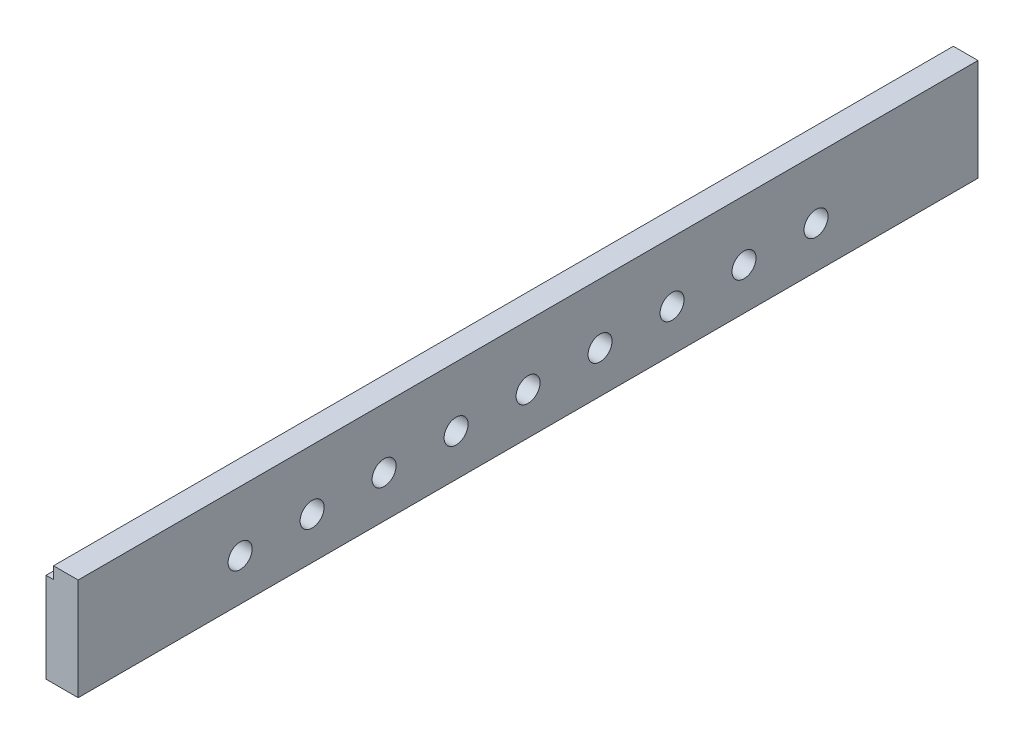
ISO-10303-21;
HEADER;
FILE_DESCRIPTION(('STEP AP214'),'2;1');
FILE_NAME('part.step','',(''),(''),'','','');
FILE_SCHEMA(('AUTOMOTIVE_DESIGN { 1 0 10303 214 1 1 1 1 }'));
ENDSEC;
DATA;
#1=APPLICATION_CONTEXT('core data for automotive mechanical design processes');
#2=APPLICATION_PROTOCOL_DEFINITION('international standard','automotive_design',2000,#1);
#3=PRODUCT_CONTEXT('',#1,'mechanical');
#4=PRODUCT('Part','Part','',(#3));
#5=PRODUCT_RELATED_PRODUCT_CATEGORY('part','',(#4));
#6=PRODUCT_DEFINITION_FORMATION('','',#4);
#7=PRODUCT_DEFINITION_CONTEXT('part definition',#1,'design');
#8=PRODUCT_DEFINITION('design','',#6,#7);
#9=PRODUCT_DEFINITION_SHAPE('','',#8);
#10=(LENGTH_UNIT() NAMED_UNIT(*) SI_UNIT(.MILLI.,.METRE.));
#11=(NAMED_UNIT(*) PLANE_ANGLE_UNIT() SI_UNIT($,.RADIAN.));
#12=(NAMED_UNIT(*) SI_UNIT($,.STERADIAN.) SOLID_ANGLE_UNIT());
#13=UNCERTAINTY_MEASURE_WITH_UNIT(LENGTH_MEASURE(1.E-05),#10,'distance_accuracy_value','');
#14=(GEOMETRIC_REPRESENTATION_CONTEXT(3) GLOBAL_UNCERTAINTY_ASSIGNED_CONTEXT((#13)) GLOBAL_UNIT_ASSIGNED_CONTEXT((#10,
#11,#12)) REPRESENTATION_CONTEXT('',''));
#15=CARTESIAN_POINT('',(0.,0.,0.));
#16=DIRECTION('',(0.,0.,1.));
#17=DIRECTION('',(1.,0.,0.));
#18=AXIS2_PLACEMENT_3D('',#15,#16,#17);
#19=CARTESIAN_POINT('',(5.36,0.,-150.));
#20=DIRECTION('',(0.,-1.,0.));
#21=DIRECTION('',(1.,0.,0.));
#22=AXIS2_PLACEMENT_3D('',#19,#20,#21);
#23=PLANE('',#22);
#24=DIRECTION('',(1.,0.,0.));
#25=VECTOR('',#24,1.);
#26=CARTESIAN_POINT('',(5.36,0.,0.));
#27=LINE('',#26,#25);
#28=CARTESIAN_POINT('',(0.,0.,0.));
#29=VERTEX_POINT('',#28);
#30=CARTESIAN_POINT('',(5.36,0.,0.));
#31=VERTEX_POINT('',#30);
#32=EDGE_CURVE('E124',#29,#31,#27,.T.);
#33=ORIENTED_EDGE('',*,*,#32,.F.);
#34=DIRECTION('',(0.,0.,1.));
#35=VECTOR('',#34,1.);
#36=CARTESIAN_POINT('',(0.,0.,-150.));
#37=LINE('',#36,#35);
#38=CARTESIAN_POINT('',(0.,0.,-150.));
#39=VERTEX_POINT('',#38);
#40=EDGE_CURVE('E53',#39,#29,#37,.T.);
#41=ORIENTED_EDGE('',*,*,#40,.F.);
#42=DIRECTION('',(1.,0.,0.));
#43=VECTOR('',#42,1.);
#44=CARTESIAN_POINT('',(5.36,0.,-150.));
#45=LINE('',#44,#43);
#46=CARTESIAN_POINT('',(5.36,0.,-150.));
#47=VERTEX_POINT('',#46);
#48=EDGE_CURVE('E140',#39,#47,#45,.T.);
#49=ORIENTED_EDGE('',*,*,#48,.T.);
#50=DIRECTION('',(0.,0.,1.));
#51=VECTOR('',#50,1.);
#52=CARTESIAN_POINT('',(5.36,0.,-150.));
#53=LINE('',#52,#51);
#54=EDGE_CURVE('E88',#47,#31,#53,.T.);
#55=ORIENTED_EDGE('',*,*,#54,.T.);
#56=EDGE_LOOP('',(#33,#41,#49,#55));
#57=FACE_BOUND('',#56,.T.);
#58=ADVANCED_FACE('F36',(#57),#23,.T.);
#59=CARTESIAN_POINT('',(0.,0.,-150.));
#60=DIRECTION('',(-1.,0.,0.));
#61=DIRECTION('',(0.,0.,1.));
#62=AXIS2_PLACEMENT_3D('',#59,#60,#61);
#63=PLANE('',#62);
#64=CARTESIAN_POINT('',(0.,7.,-111.));
#65=DIRECTION('',(-1.,0.,0.));
#66=DIRECTION('',(0.,0.,1.));
#67=AXIS2_PLACEMENT_3D('',#64,#65,#66);
#68=CIRCLE('',#67,2.);
#69=CARTESIAN_POINT('',(0.,7.,-109.));
#70=VERTEX_POINT('',#69);
#71=EDGE_CURVE('E383',#70,#70,#68,.T.);
#72=ORIENTED_EDGE('',*,*,#71,.F.);
#73=EDGE_LOOP('',(#72));
#74=FACE_BOUND('',#73,.T.);
#75=CARTESIAN_POINT('',(0.,7.,-123.));
#76=DIRECTION('',(-1.,0.,0.));
#77=DIRECTION('',(0.,0.,1.));
#78=AXIS2_PLACEMENT_3D('',#75,#76,#77);
#79=CIRCLE('',#78,2.);
#80=CARTESIAN_POINT('',(0.,7.,-121.));
#81=VERTEX_POINT('',#80);
#82=EDGE_CURVE('E384',#81,#81,#79,.T.);
#83=ORIENTED_EDGE('',*,*,#82,.F.);
#84=EDGE_LOOP('',(#83));
#85=FACE_BOUND('',#84,.T.);
#86=DIRECTION('',(0.,-1.,0.));
#87=VECTOR('',#86,1.);
#88=CARTESIAN_POINT('',(0.,0.,0.));
#89=LINE('',#88,#87);
#90=CARTESIAN_POINT('',(0.,15.,0.));
#91=VERTEX_POINT('',#90);
#92=EDGE_CURVE('E137',#91,#29,#89,.T.);
#93=ORIENTED_EDGE('',*,*,#92,.F.);
#94=DIRECTION('',(0.,0.,1.));
#95=VECTOR('',#94,1.);
#96=CARTESIAN_POINT('',(0.,15.,-150.));
#97=LINE('',#96,#95);
#98=CARTESIAN_POINT('',(0.,15.,-150.));
#99=VERTEX_POINT('',#98);
#100=EDGE_CURVE('E76',#99,#91,#97,.T.);
#101=ORIENTED_EDGE('',*,*,#100,.F.);
#102=DIRECTION('',(0.,-1.,0.));
#103=VECTOR('',#102,1.);
#104=CARTESIAN_POINT('',(0.,0.,-150.));
#105=LINE('',#104,#103);
#106=EDGE_CURVE('E114',#99,#39,#105,.T.);
#107=ORIENTED_EDGE('',*,*,#106,.T.);
#108=ORIENTED_EDGE('',*,*,#40,.T.);
#109=EDGE_LOOP('',(#93,#101,#107,#108));
#110=FACE_BOUND('',#109,.T.);
#111=CARTESIAN_POINT('',(0.,7.,-99.));
#112=DIRECTION('',(-1.,0.,0.));
#113=DIRECTION('',(0.,0.,1.));
#114=AXIS2_PLACEMENT_3D('',#111,#112,#113);
#115=CIRCLE('',#114,2.);
#116=CARTESIAN_POINT('',(0.,7.,-97.));
#117=VERTEX_POINT('',#116);
#118=EDGE_CURVE('E150',#117,#117,#115,.T.);
#119=ORIENTED_EDGE('',*,*,#118,.F.);
#120=EDGE_LOOP('',(#119));
#121=FACE_BOUND('',#120,.T.);
#122=CARTESIAN_POINT('',(0.,7.,-87.));
#123=DIRECTION('',(-1.,0.,0.));
#124=DIRECTION('',(0.,0.,1.));
#125=AXIS2_PLACEMENT_3D('',#122,#123,#124);
#126=CIRCLE('',#125,2.);
#127=CARTESIAN_POINT('',(0.,7.,-85.));
#128=VERTEX_POINT('',#127);
#129=EDGE_CURVE('E156',#128,#128,#126,.T.);
#130=ORIENTED_EDGE('',*,*,#129,.F.);
#131=EDGE_LOOP('',(#130));
#132=FACE_BOUND('',#131,.T.);
#133=CARTESIAN_POINT('',(0.,7.,-75.));
#134=DIRECTION('',(-1.,0.,0.));
#135=DIRECTION('',(0.,0.,1.));
#136=AXIS2_PLACEMENT_3D('',#133,#134,#135);
#137=CIRCLE('',#136,2.);
#138=CARTESIAN_POINT('',(0.,7.,-73.));
#139=VERTEX_POINT('',#138);
#140=EDGE_CURVE('E162',#139,#139,#137,.T.);
#141=ORIENTED_EDGE('',*,*,#140,.F.);
#142=EDGE_LOOP('',(#141));
#143=FACE_BOUND('',#142,.T.);
#144=CARTESIAN_POINT('',(0.,7.,-63.));
#145=DIRECTION('',(-1.,0.,0.));
#146=DIRECTION('',(0.,0.,1.));
#147=AXIS2_PLACEMENT_3D('',#144,#145,#146);
#148=CIRCLE('',#147,2.);
#149=CARTESIAN_POINT('',(0.,7.,-61.));
#150=VERTEX_POINT('',#149);
#151=EDGE_CURVE('E168',#150,#150,#148,.T.);
#152=ORIENTED_EDGE('',*,*,#151,.F.);
#153=EDGE_LOOP('',(#152));
#154=FACE_BOUND('',#153,.T.);
#155=CARTESIAN_POINT('',(0.,7.,-51.));
#156=DIRECTION('',(-1.,0.,0.));
#157=DIRECTION('',(0.,0.,1.));
#158=AXIS2_PLACEMENT_3D('',#155,#156,#157);
#159=CIRCLE('',#158,2.);
#160=CARTESIAN_POINT('',(0.,7.,-49.));
#161=VERTEX_POINT('',#160);
#162=EDGE_CURVE('E174',#161,#161,#159,.T.);
#163=ORIENTED_EDGE('',*,*,#162,.F.);
#164=EDGE_LOOP('',(#163));
#165=FACE_BOUND('',#164,.T.);
#166=CARTESIAN_POINT('',(0.,7.,-39.));
#167=DIRECTION('',(-1.,0.,0.));
#168=DIRECTION('',(0.,0.,1.));
#169=AXIS2_PLACEMENT_3D('',#166,#167,#168);
#170=CIRCLE('',#169,2.);
#171=CARTESIAN_POINT('',(0.,7.,-37.));
#172=VERTEX_POINT('',#171);
#173=EDGE_CURVE('E180',#172,#172,#170,.T.);
#174=ORIENTED_EDGE('',*,*,#173,.F.);
#175=EDGE_LOOP('',(#174));
#176=FACE_BOUND('',#175,.T.);
#177=CARTESIAN_POINT('',(0.,7.,-27.));
#178=DIRECTION('',(-1.,0.,0.));
#179=DIRECTION('',(0.,0.,1.));
#180=AXIS2_PLACEMENT_3D('',#177,#178,#179);
#181=CIRCLE('',#180,2.);
#182=CARTESIAN_POINT('',(0.,7.,-25.));
#183=VERTEX_POINT('',#182);
#184=EDGE_CURVE('E11',#183,#183,#181,.T.);
#185=ORIENTED_EDGE('',*,*,#184,.F.);
#186=EDGE_LOOP('',(#185));
#187=FACE_BOUND('',#186,.T.);
#188=ADVANCED_FACE('F192',(#74,#85,#110,#121,#132,#143,#154,#165,#176,#187),#63,.T.);
#189=CARTESIAN_POINT('',(0.,15.,-150.));
#190=DIRECTION('',(0.,1.,0.));
#191=DIRECTION('',(0.,0.,1.));
#192=AXIS2_PLACEMENT_3D('',#189,#190,#191);
#193=PLANE('',#192);
#194=DIRECTION('',(-1.,0.,0.));
#195=VECTOR('',#194,1.);
#196=CARTESIAN_POINT('',(0.,15.,0.));
#197=LINE('',#196,#195);
#198=CARTESIAN_POINT('',(1.25,15.,0.));
#199=VERTEX_POINT('',#198);
#200=EDGE_CURVE('E101',#199,#91,#197,.T.);
#201=ORIENTED_EDGE('',*,*,#200,.F.);
#202=DIRECTION('',(0.,0.,1.));
#203=VECTOR('',#202,1.);
#204=CARTESIAN_POINT('',(1.25,15.,-150.));
#205=LINE('',#204,#203);
#206=CARTESIAN_POINT('',(1.25,15.,-150.));
#207=VERTEX_POINT('',#206);
#208=EDGE_CURVE('E96',#207,#199,#205,.T.);
#209=ORIENTED_EDGE('',*,*,#208,.F.);
#210=DIRECTION('',(-1.,0.,0.));
#211=VECTOR('',#210,1.);
#212=CARTESIAN_POINT('',(0.,15.,-150.));
#213=LINE('',#212,#211);
#214=EDGE_CURVE('E99',#207,#99,#213,.T.);
#215=ORIENTED_EDGE('',*,*,#214,.T.);
#216=ORIENTED_EDGE('',*,*,#100,.T.);
#217=EDGE_LOOP('',(#201,#209,#215,#216));
#218=FACE_BOUND('',#217,.T.);
#219=ADVANCED_FACE('F98',(#218),#193,.T.);
#220=CARTESIAN_POINT('',(1.25,15.,-150.));
#221=DIRECTION('',(-1.,0.,0.));
#222=DIRECTION('',(0.,0.,1.));
#223=AXIS2_PLACEMENT_3D('',#220,#221,#222);
#224=PLANE('',#223);
#225=DIRECTION('',(0.,-1.,0.));
#226=VECTOR('',#225,1.);
#227=CARTESIAN_POINT('',(1.25,15.,0.));
#228=LINE('',#227,#226);
#229=CARTESIAN_POINT('',(1.25,17.,0.));
#230=VERTEX_POINT('',#229);
#231=EDGE_CURVE('E134',#230,#199,#228,.T.);
#232=ORIENTED_EDGE('',*,*,#231,.F.);
#233=DIRECTION('',(0.,0.,1.));
#234=VECTOR('',#233,1.);
#235=CARTESIAN_POINT('',(1.25,17.,-150.));
#236=LINE('',#235,#234);
#237=CARTESIAN_POINT('',(1.25,17.,-150.));
#238=VERTEX_POINT('',#237);
#239=EDGE_CURVE('E106',#238,#230,#236,.T.);
#240=ORIENTED_EDGE('',*,*,#239,.F.);
#241=DIRECTION('',(0.,-1.,0.));
#242=VECTOR('',#241,1.);
#243=CARTESIAN_POINT('',(1.25,15.,-150.));
#244=LINE('',#243,#242);
#245=EDGE_CURVE('E112',#238,#207,#244,.T.);
#246=ORIENTED_EDGE('',*,*,#245,.T.);
#247=ORIENTED_EDGE('',*,*,#208,.T.);
#248=EDGE_LOOP('',(#232,#240,#246,#247));
#249=FACE_BOUND('',#248,.T.);
#250=ADVANCED_FACE('F116',(#249),#224,.T.);
#251=CARTESIAN_POINT('',(1.25,17.,-150.));
#252=DIRECTION('',(0.,1.,0.));
#253=DIRECTION('',(0.,0.,1.));
#254=AXIS2_PLACEMENT_3D('',#251,#252,#253);
#255=PLANE('',#254);
#256=DIRECTION('',(-1.,0.,0.));
#257=VECTOR('',#256,1.);
#258=CARTESIAN_POINT('',(1.25,17.,0.));
#259=LINE('',#258,#257);
#260=CARTESIAN_POINT('',(5.36,17.,0.));
#261=VERTEX_POINT('',#260);
#262=EDGE_CURVE('E131',#261,#230,#259,.T.);
#263=ORIENTED_EDGE('',*,*,#262,.F.);
#264=DIRECTION('',(0.,0.,1.));
#265=VECTOR('',#264,1.);
#266=CARTESIAN_POINT('',(5.36,17.,-150.));
#267=LINE('',#266,#265);
#268=CARTESIAN_POINT('',(5.36,17.,-150.));
#269=VERTEX_POINT('',#268);
#270=EDGE_CURVE('E145',#269,#261,#267,.T.);
#271=ORIENTED_EDGE('',*,*,#270,.F.);
#272=DIRECTION('',(-1.,0.,0.));
#273=VECTOR('',#272,1.);
#274=CARTESIAN_POINT('',(1.25,17.,-150.));
#275=LINE('',#274,#273);
#276=EDGE_CURVE('E117',#269,#238,#275,.T.);
#277=ORIENTED_EDGE('',*,*,#276,.T.);
#278=ORIENTED_EDGE('',*,*,#239,.T.);
#279=EDGE_LOOP('',(#263,#271,#277,#278));
#280=FACE_BOUND('',#279,.T.);
#281=ADVANCED_FACE('F210',(#280),#255,.T.);
#282=CARTESIAN_POINT('',(5.36,17.,-150.));
#283=DIRECTION('',(1.,0.,0.));
#284=DIRECTION('',(0.,1.,0.));
#285=AXIS2_PLACEMENT_3D('',#282,#283,#284);
#286=PLANE('',#285);
#287=CARTESIAN_POINT('',(5.36,7.,-111.));
#288=DIRECTION('',(-1.,0.,0.));
#289=DIRECTION('',(0.,0.,1.));
#290=AXIS2_PLACEMENT_3D('',#287,#288,#289);
#291=CIRCLE('',#290,2.);
#292=CARTESIAN_POINT('',(5.36,7.,-109.));
#293=VERTEX_POINT('',#292);
#294=EDGE_CURVE('E381',#293,#293,#291,.T.);
#295=ORIENTED_EDGE('',*,*,#294,.T.);
#296=EDGE_LOOP('',(#295));
#297=FACE_BOUND('',#296,.T.);
#298=CARTESIAN_POINT('',(5.36,7.,-123.));
#299=DIRECTION('',(-1.,0.,0.));
#300=DIRECTION('',(0.,0.,1.));
#301=AXIS2_PLACEMENT_3D('',#298,#299,#300);
#302=CIRCLE('',#301,2.);
#303=CARTESIAN_POINT('',(5.36,7.,-121.));
#304=VERTEX_POINT('',#303);
#305=EDGE_CURVE('E128',#304,#304,#302,.T.);
#306=ORIENTED_EDGE('',*,*,#305,.T.);
#307=EDGE_LOOP('',(#306));
#308=FACE_BOUND('',#307,.T.);
#309=DIRECTION('',(0.,1.,0.));
#310=VECTOR('',#309,1.);
#311=CARTESIAN_POINT('',(5.36,17.,0.));
#312=LINE('',#311,#310);
#313=EDGE_CURVE('E127',#31,#261,#312,.T.);
#314=ORIENTED_EDGE('',*,*,#313,.F.);
#315=ORIENTED_EDGE('',*,*,#54,.F.);
#316=DIRECTION('',(0.,1.,0.));
#317=VECTOR('',#316,1.);
#318=CARTESIAN_POINT('',(5.36,17.,-150.));
#319=LINE('',#318,#317);
#320=EDGE_CURVE('E119',#47,#269,#319,.T.);
#321=ORIENTED_EDGE('',*,*,#320,.T.);
#322=ORIENTED_EDGE('',*,*,#270,.T.);
#323=EDGE_LOOP('',(#314,#315,#321,#322));
#324=FACE_BOUND('',#323,.T.);
#325=CARTESIAN_POINT('',(5.36,7.,-99.));
#326=DIRECTION('',(-1.,0.,0.));
#327=DIRECTION('',(0.,0.,1.));
#328=AXIS2_PLACEMENT_3D('',#325,#326,#327);
#329=CIRCLE('',#328,2.);
#330=CARTESIAN_POINT('',(5.36,7.,-97.));
#331=VERTEX_POINT('',#330);
#332=EDGE_CURVE('E142',#331,#331,#329,.T.);
#333=ORIENTED_EDGE('',*,*,#332,.T.);
#334=EDGE_LOOP('',(#333));
#335=FACE_BOUND('',#334,.T.);
#336=CARTESIAN_POINT('',(5.36,7.,-87.));
#337=DIRECTION('',(-1.,0.,0.));
#338=DIRECTION('',(0.,0.,1.));
#339=AXIS2_PLACEMENT_3D('',#336,#337,#338);
#340=CIRCLE('',#339,2.);
#341=CARTESIAN_POINT('',(5.36,7.,-85.));
#342=VERTEX_POINT('',#341);
#343=EDGE_CURVE('E153',#342,#342,#340,.T.);
#344=ORIENTED_EDGE('',*,*,#343,.T.);
#345=EDGE_LOOP('',(#344));
#346=FACE_BOUND('',#345,.T.);
#347=CARTESIAN_POINT('',(5.36,7.,-75.));
#348=DIRECTION('',(-1.,0.,0.));
#349=DIRECTION('',(0.,0.,1.));
#350=AXIS2_PLACEMENT_3D('',#347,#348,#349);
#351=CIRCLE('',#350,2.);
#352=CARTESIAN_POINT('',(5.36,7.,-73.));
#353=VERTEX_POINT('',#352);
#354=EDGE_CURVE('E159',#353,#353,#351,.T.);
#355=ORIENTED_EDGE('',*,*,#354,.T.);
#356=EDGE_LOOP('',(#355));
#357=FACE_BOUND('',#356,.T.);
#358=CARTESIAN_POINT('',(5.36,7.,-63.));
#359=DIRECTION('',(-1.,0.,0.));
#360=DIRECTION('',(0.,0.,1.));
#361=AXIS2_PLACEMENT_3D('',#358,#359,#360);
#362=CIRCLE('',#361,2.);
#363=CARTESIAN_POINT('',(5.36,7.,-61.));
#364=VERTEX_POINT('',#363);
#365=EDGE_CURVE('E165',#364,#364,#362,.T.);
#366=ORIENTED_EDGE('',*,*,#365,.T.);
#367=EDGE_LOOP('',(#366));
#368=FACE_BOUND('',#367,.T.);
#369=CARTESIAN_POINT('',(5.36,7.,-51.));
#370=DIRECTION('',(-1.,0.,0.));
#371=DIRECTION('',(0.,0.,1.));
#372=AXIS2_PLACEMENT_3D('',#369,#370,#371);
#373=CIRCLE('',#372,2.);
#374=CARTESIAN_POINT('',(5.36,7.,-49.));
#375=VERTEX_POINT('',#374);
#376=EDGE_CURVE('E171',#375,#375,#373,.T.);
#377=ORIENTED_EDGE('',*,*,#376,.T.);
#378=EDGE_LOOP('',(#377));
#379=FACE_BOUND('',#378,.T.);
#380=CARTESIAN_POINT('',(5.36,7.,-39.));
#381=DIRECTION('',(-1.,0.,0.));
#382=DIRECTION('',(0.,0.,1.));
#383=AXIS2_PLACEMENT_3D('',#380,#381,#382);
#384=CIRCLE('',#383,2.);
#385=CARTESIAN_POINT('',(5.36,7.,-37.));
#386=VERTEX_POINT('',#385);
#387=EDGE_CURVE('E177',#386,#386,#384,.T.);
#388=ORIENTED_EDGE('',*,*,#387,.T.);
#389=EDGE_LOOP('',(#388));
#390=FACE_BOUND('',#389,.T.);
#391=CARTESIAN_POINT('',(5.36,7.,-27.));
#392=DIRECTION('',(-1.,0.,0.));
#393=DIRECTION('',(0.,0.,1.));
#394=AXIS2_PLACEMENT_3D('',#391,#392,#393);
#395=CIRCLE('',#394,2.);
#396=CARTESIAN_POINT('',(5.36,7.,-25.));
#397=VERTEX_POINT('',#396);
#398=EDGE_CURVE('E45',#397,#397,#395,.T.);
#399=ORIENTED_EDGE('',*,*,#398,.T.);
#400=EDGE_LOOP('',(#399));
#401=FACE_BOUND('',#400,.T.);
#402=ADVANCED_FACE('F185',(#297,#308,#324,#335,#346,#357,#368,#379,#390,#401),#286,.T.);
#403=CARTESIAN_POINT('',(5.36,0.,-150.));
#404=DIRECTION('',(0.,0.,1.));
#405=DIRECTION('',(1.,0.,0.));
#406=AXIS2_PLACEMENT_3D('',#403,#404,#405);
#407=PLANE('',#406);
#408=ORIENTED_EDGE('',*,*,#48,.F.);
#409=ORIENTED_EDGE('',*,*,#106,.F.);
#410=ORIENTED_EDGE('',*,*,#214,.F.);
#411=ORIENTED_EDGE('',*,*,#245,.F.);
#412=ORIENTED_EDGE('',*,*,#276,.F.);
#413=ORIENTED_EDGE('',*,*,#320,.F.);
#414=EDGE_LOOP('',(#408,#409,#410,#411,#412,#413));
#415=FACE_BOUND('',#414,.T.);
#416=ADVANCED_FACE('F110',(#415),#407,.F.);
#417=CARTESIAN_POINT('',(5.36,0.,0.));
#418=DIRECTION('',(0.,0.,1.));
#419=DIRECTION('',(1.,0.,0.));
#420=AXIS2_PLACEMENT_3D('',#417,#418,#419);
#421=PLANE('',#420);
#422=ORIENTED_EDGE('',*,*,#32,.T.);
#423=ORIENTED_EDGE('',*,*,#313,.T.);
#424=ORIENTED_EDGE('',*,*,#262,.T.);
#425=ORIENTED_EDGE('',*,*,#231,.T.);
#426=ORIENTED_EDGE('',*,*,#200,.T.);
#427=ORIENTED_EDGE('',*,*,#92,.T.);
#428=EDGE_LOOP('',(#422,#423,#424,#425,#426,#427));
#429=FACE_BOUND('',#428,.T.);
#430=ADVANCED_FACE('F205',(#429),#421,.T.);
#431=CARTESIAN_POINT('',(5.36,7.,-123.));
#432=DIRECTION('',(-1.,0.,0.));
#433=DIRECTION('',(0.,0.,1.));
#434=AXIS2_PLACEMENT_3D('',#431,#432,#433);
#435=CYLINDRICAL_SURFACE('',#434,2.);
#436=ORIENTED_EDGE('',*,*,#305,.F.);
#437=EDGE_LOOP('',(#436));
#438=FACE_BOUND('',#437,.T.);
#439=ORIENTED_EDGE('',*,*,#82,.T.);
#440=EDGE_LOOP('',(#439));
#441=FACE_BOUND('',#440,.T.);
#442=ADVANCED_FACE('F257',(#438,#441),#435,.F.);
#443=CARTESIAN_POINT('',(5.36,7.,-111.));
#444=DIRECTION('',(-1.,0.,0.));
#445=DIRECTION('',(0.,0.,1.));
#446=AXIS2_PLACEMENT_3D('',#443,#444,#445);
#447=CYLINDRICAL_SURFACE('',#446,2.);
#448=ORIENTED_EDGE('',*,*,#294,.F.);
#449=EDGE_LOOP('',(#448));
#450=FACE_BOUND('',#449,.T.);
#451=ORIENTED_EDGE('',*,*,#71,.T.);
#452=EDGE_LOOP('',(#451));
#453=FACE_BOUND('',#452,.T.);
#454=ADVANCED_FACE('F221',(#450,#453),#447,.F.);
#455=CARTESIAN_POINT('',(5.36,7.,-99.));
#456=DIRECTION('',(-1.,0.,0.));
#457=DIRECTION('',(0.,0.,1.));
#458=AXIS2_PLACEMENT_3D('',#455,#456,#457);
#459=CYLINDRICAL_SURFACE('',#458,2.);
#460=ORIENTED_EDGE('',*,*,#332,.F.);
#461=EDGE_LOOP('',(#460));
#462=FACE_BOUND('',#461,.T.);
#463=ORIENTED_EDGE('',*,*,#118,.T.);
#464=EDGE_LOOP('',(#463));
#465=FACE_BOUND('',#464,.T.);
#466=ADVANCED_FACE('F217',(#462,#465),#459,.F.);
#467=CARTESIAN_POINT('',(5.36,7.,-87.));
#468=DIRECTION('',(-1.,0.,0.));
#469=DIRECTION('',(0.,0.,1.));
#470=AXIS2_PLACEMENT_3D('',#467,#468,#469);
#471=CYLINDRICAL_SURFACE('',#470,2.);
#472=ORIENTED_EDGE('',*,*,#343,.F.);
#473=EDGE_LOOP('',(#472));
#474=FACE_BOUND('',#473,.T.);
#475=ORIENTED_EDGE('',*,*,#129,.T.);
#476=EDGE_LOOP('',(#475));
#477=FACE_BOUND('',#476,.T.);
#478=ADVANCED_FACE('F220',(#474,#477),#471,.F.);
#479=CARTESIAN_POINT('',(5.36,7.,-75.));
#480=DIRECTION('',(-1.,0.,0.));
#481=DIRECTION('',(0.,0.,1.));
#482=AXIS2_PLACEMENT_3D('',#479,#480,#481);
#483=CYLINDRICAL_SURFACE('',#482,2.);
#484=ORIENTED_EDGE('',*,*,#354,.F.);
#485=EDGE_LOOP('',(#484));
#486=FACE_BOUND('',#485,.T.);
#487=ORIENTED_EDGE('',*,*,#140,.T.);
#488=EDGE_LOOP('',(#487));
#489=FACE_BOUND('',#488,.T.);
#490=ADVANCED_FACE('F225',(#486,#489),#483,.F.);
#491=CARTESIAN_POINT('',(5.36,7.,-63.));
#492=DIRECTION('',(-1.,0.,0.));
#493=DIRECTION('',(0.,0.,1.));
#494=AXIS2_PLACEMENT_3D('',#491,#492,#493);
#495=CYLINDRICAL_SURFACE('',#494,2.);
#496=ORIENTED_EDGE('',*,*,#365,.F.);
#497=EDGE_LOOP('',(#496));
#498=FACE_BOUND('',#497,.T.);
#499=ORIENTED_EDGE('',*,*,#151,.T.);
#500=EDGE_LOOP('',(#499));
#501=FACE_BOUND('',#500,.T.);
#502=ADVANCED_FACE('F229',(#498,#501),#495,.F.);
#503=CARTESIAN_POINT('',(5.36,7.,-51.));
#504=DIRECTION('',(-1.,0.,0.));
#505=DIRECTION('',(0.,0.,1.));
#506=AXIS2_PLACEMENT_3D('',#503,#504,#505);
#507=CYLINDRICAL_SURFACE('',#506,2.);
#508=ORIENTED_EDGE('',*,*,#376,.F.);
#509=EDGE_LOOP('',(#508));
#510=FACE_BOUND('',#509,.T.);
#511=ORIENTED_EDGE('',*,*,#162,.T.);
#512=EDGE_LOOP('',(#511));
#513=FACE_BOUND('',#512,.T.);
#514=ADVANCED_FACE('F233',(#510,#513),#507,.F.);
#515=CARTESIAN_POINT('',(5.36,7.,-39.));
#516=DIRECTION('',(-1.,0.,0.));
#517=DIRECTION('',(0.,0.,1.));
#518=AXIS2_PLACEMENT_3D('',#515,#516,#517);
#519=CYLINDRICAL_SURFACE('',#518,2.);
#520=ORIENTED_EDGE('',*,*,#387,.F.);
#521=EDGE_LOOP('',(#520));
#522=FACE_BOUND('',#521,.T.);
#523=ORIENTED_EDGE('',*,*,#173,.T.);
#524=EDGE_LOOP('',(#523));
#525=FACE_BOUND('',#524,.T.);
#526=ADVANCED_FACE('F189',(#522,#525),#519,.F.);
#527=CARTESIAN_POINT('',(5.36,7.,-27.));
#528=DIRECTION('',(-1.,0.,0.));
#529=DIRECTION('',(0.,0.,1.));
#530=AXIS2_PLACEMENT_3D('',#527,#528,#529);
#531=CYLINDRICAL_SURFACE('',#530,2.);
#532=ORIENTED_EDGE('',*,*,#398,.F.);
#533=EDGE_LOOP('',(#532));
#534=FACE_BOUND('',#533,.T.);
#535=ORIENTED_EDGE('',*,*,#184,.T.);
#536=EDGE_LOOP('',(#535));
#537=FACE_BOUND('',#536,.T.);
#538=ADVANCED_FACE('F38',(#534,#537),#531,.F.);
#539=CLOSED_SHELL('',(#58,#188,#219,#250,#281,#402,#416,#430,#442,#454,#466,#478,#490,#502,#514,
#526,#538));
#540=MANIFOLD_SOLID_BREP('B2',#539);
#541=ADVANCED_BREP_SHAPE_REPRESENTATION('',(#18,#540),#14);
#542=SHAPE_DEFINITION_REPRESENTATION(#9,#541);
ENDSEC;
END-ISO-10303-21;
